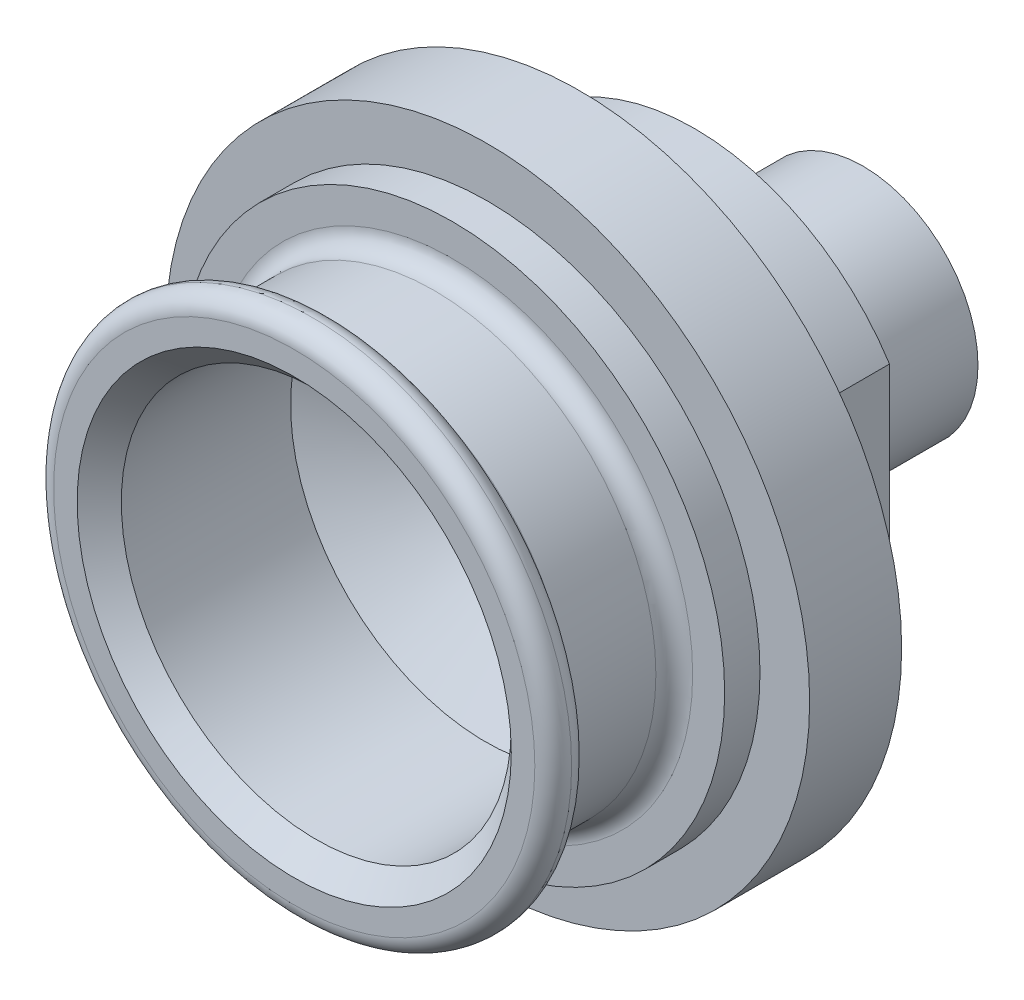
ISO-10303-21;
HEADER;
FILE_DESCRIPTION(('STEP AP214'),'2;1');
FILE_NAME('part.step','',(''),(''),'','','');
FILE_SCHEMA(('AUTOMOTIVE_DESIGN { 1 0 10303 214 1 1 1 1 }'));
ENDSEC;
DATA;
#1=APPLICATION_CONTEXT('core data for automotive mechanical design processes');
#2=APPLICATION_PROTOCOL_DEFINITION('international standard','automotive_design',2000,#1);
#3=PRODUCT_CONTEXT('',#1,'mechanical');
#4=PRODUCT('Part','Part','',(#3));
#5=PRODUCT_RELATED_PRODUCT_CATEGORY('part','',(#4));
#6=PRODUCT_DEFINITION_FORMATION('','',#4);
#7=PRODUCT_DEFINITION_CONTEXT('part definition',#1,'design');
#8=PRODUCT_DEFINITION('design','',#6,#7);
#9=PRODUCT_DEFINITION_SHAPE('','',#8);
#10=(LENGTH_UNIT() NAMED_UNIT(*) SI_UNIT(.MILLI.,.METRE.));
#11=(NAMED_UNIT(*) PLANE_ANGLE_UNIT() SI_UNIT($,.RADIAN.));
#12=(NAMED_UNIT(*) SI_UNIT($,.STERADIAN.) SOLID_ANGLE_UNIT());
#13=UNCERTAINTY_MEASURE_WITH_UNIT(LENGTH_MEASURE(1.E-05),#10,'distance_accuracy_value','');
#14=(GEOMETRIC_REPRESENTATION_CONTEXT(3) GLOBAL_UNCERTAINTY_ASSIGNED_CONTEXT((#13)) GLOBAL_UNIT_ASSIGNED_CONTEXT((#10,
#11,#12)) REPRESENTATION_CONTEXT('',''));
#15=CARTESIAN_POINT('',(0.,0.,0.));
#16=DIRECTION('',(0.,0.,1.));
#17=DIRECTION('',(1.,0.,0.));
#18=AXIS2_PLACEMENT_3D('',#15,#16,#17);
#19=CARTESIAN_POINT('',(0.,0.,9.779));
#20=DIRECTION('',(0.,0.,-1.));
#21=DIRECTION('',(-1.00000000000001,0.,0.));
#22=AXIS2_PLACEMENT_3D('',#19,#20,#21);
#23=CYLINDRICAL_SURFACE('',#22,8.001);
#24=CARTESIAN_POINT('',(0.,0.,9.779));
#25=DIRECTION('',(0.,0.,1.));
#26=DIRECTION('',(1.00000000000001,0.,0.));
#27=AXIS2_PLACEMENT_3D('',#24,#25,#26);
#28=CIRCLE('',#27,8.001);
#29=CARTESIAN_POINT('',(6.73100000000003,4.32546413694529,9.779));
#30=VERTEX_POINT('',#29);
#31=CARTESIAN_POINT('',(-6.73100000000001,4.32546413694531,9.779));
#32=VERTEX_POINT('',#31);
#33=EDGE_CURVE('E93',#30,#32,#28,.T.);
#34=ORIENTED_EDGE('',*,*,#33,.F.);
#35=DIRECTION('',(0.,0.,-1.));
#36=VECTOR('',#35,1.);
#37=CARTESIAN_POINT('',(6.73100000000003,4.32546413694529,9.779));
#38=LINE('',#37,#36);
#39=CARTESIAN_POINT('',(6.73100000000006,4.32546413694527,5.8166));
#40=VERTEX_POINT('',#39);
#41=EDGE_CURVE('E46',#30,#40,#38,.T.);
#42=ORIENTED_EDGE('',*,*,#41,.T.);
#43=CARTESIAN_POINT('',(0.,0.,5.8166));
#44=DIRECTION('',(0.,0.,1.));
#45=DIRECTION('',(1.00000000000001,0.,0.));
#46=AXIS2_PLACEMENT_3D('',#43,#44,#45);
#47=CIRCLE('',#46,8.001);
#48=CARTESIAN_POINT('',(-6.731,4.32546413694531,5.8166));
#49=VERTEX_POINT('',#48);
#50=EDGE_CURVE('E258',#40,#49,#47,.T.);
#51=ORIENTED_EDGE('',*,*,#50,.T.);
#52=DIRECTION('',(0.,0.,-1.));
#53=VECTOR('',#52,1.);
#54=CARTESIAN_POINT('',(-6.73100000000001,4.32546413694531,9.779));
#55=LINE('',#54,#53);
#56=EDGE_CURVE('E253',#49,#32,#55,.F.);
#57=ORIENTED_EDGE('',*,*,#56,.T.);
#58=EDGE_LOOP('',(#34,#42,#51,#57));
#59=FACE_BOUND('',#58,.T.);
#60=ADVANCED_FACE('F31',(#59),#23,.T.);
#61=CARTESIAN_POINT('',(0.,0.,4.2418));
#62=DIRECTION('',(0.,0.,-1.));
#63=DIRECTION('',(-1.00000000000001,0.,0.));
#64=AXIS2_PLACEMENT_3D('',#61,#62,#63);
#65=CYLINDRICAL_SURFACE('',#64,3.96875);
#66=CARTESIAN_POINT('',(0.,0.,4.2418));
#67=DIRECTION('',(0.,0.,1.));
#68=DIRECTION('',(1.00000000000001,0.,0.));
#69=AXIS2_PLACEMENT_3D('',#66,#67,#68);
#70=CIRCLE('',#69,3.96875);
#71=CARTESIAN_POINT('',(-3.96875000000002,0.,4.2418));
#72=VERTEX_POINT('',#71);
#73=EDGE_CURVE('E104',#72,#72,#70,.T.);
#74=CARTESIAN_POINT('',(0.,0.,0.));
#75=DIRECTION('',(0.,0.,1.));
#76=DIRECTION('',(1.00000000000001,0.,0.));
#77=AXIS2_PLACEMENT_3D('',#74,#75,#76);
#78=CIRCLE('',#77,3.96875);
#79=CARTESIAN_POINT('',(-3.96875000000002,0.,0.));
#80=VERTEX_POINT('',#79);
#81=EDGE_CURVE('E96',#80,#80,#78,.T.);
#82=CARTESIAN_POINT('',(-3.96875000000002,0.,4.2418));
#83=CARTESIAN_POINT('',(-3.96875000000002,0.,4.19761458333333));
#84=CARTESIAN_POINT('',(-3.96875000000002,0.,4.15342916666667));
#85=CARTESIAN_POINT('',(-3.96875000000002,0.,4.06505833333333));
#86=CARTESIAN_POINT('',(-3.96875000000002,0.,4.02087291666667));
#87=CARTESIAN_POINT('',(-3.96875000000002,0.,3.93250208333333));
#88=CARTESIAN_POINT('',(-3.96875000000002,0.,3.88831666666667));
#89=CARTESIAN_POINT('',(-3.96875000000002,0.,3.79994583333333));
#90=CARTESIAN_POINT('',(-3.96875000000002,0.,3.75576041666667));
#91=CARTESIAN_POINT('',(-3.96875000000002,0.,3.66738958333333));
#92=CARTESIAN_POINT('',(-3.96875000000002,0.,3.62320416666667));
#93=CARTESIAN_POINT('',(-3.96875000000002,0.,3.53483333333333));
#94=CARTESIAN_POINT('',(-3.96875000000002,0.,3.49064791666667));
#95=CARTESIAN_POINT('',(-3.96875000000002,0.,3.40227708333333));
#96=CARTESIAN_POINT('',(-3.96875000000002,0.,3.35809166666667));
#97=CARTESIAN_POINT('',(-3.96875000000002,0.,3.26972083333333));
#98=CARTESIAN_POINT('',(-3.96875000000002,0.,3.22553541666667));
#99=CARTESIAN_POINT('',(-3.96875000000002,0.,3.13716458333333));
#100=CARTESIAN_POINT('',(-3.96875000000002,0.,3.09297916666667));
#101=CARTESIAN_POINT('',(-3.96875000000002,0.,3.00460833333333));
#102=CARTESIAN_POINT('',(-3.96875000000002,0.,2.96042291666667));
#103=CARTESIAN_POINT('',(-3.96875000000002,0.,2.87205208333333));
#104=CARTESIAN_POINT('',(-3.96875000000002,0.,2.82786666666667));
#105=CARTESIAN_POINT('',(-3.96875000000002,0.,2.73949583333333));
#106=CARTESIAN_POINT('',(-3.96875000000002,0.,2.69531041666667));
#107=CARTESIAN_POINT('',(-3.96875000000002,0.,2.60693958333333));
#108=CARTESIAN_POINT('',(-3.96875000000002,0.,2.56275416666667));
#109=CARTESIAN_POINT('',(-3.96875000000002,0.,2.47438333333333));
#110=CARTESIAN_POINT('',(-3.96875000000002,0.,2.43019791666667));
#111=CARTESIAN_POINT('',(-3.96875000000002,0.,2.34182708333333));
#112=CARTESIAN_POINT('',(-3.96875000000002,0.,2.29764166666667));
#113=CARTESIAN_POINT('',(-3.96875000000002,0.,2.20927083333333));
#114=CARTESIAN_POINT('',(-3.96875000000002,0.,2.16508541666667));
#115=CARTESIAN_POINT('',(-3.96875000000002,0.,2.07671458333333));
#116=CARTESIAN_POINT('',(-3.96875000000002,0.,2.03252916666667));
#117=CARTESIAN_POINT('',(-3.96875000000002,0.,1.94415833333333));
#118=CARTESIAN_POINT('',(-3.96875000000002,0.,1.89997291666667));
#119=CARTESIAN_POINT('',(-3.96875000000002,0.,1.81160208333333));
#120=CARTESIAN_POINT('',(-3.96875000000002,0.,1.76741666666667));
#121=CARTESIAN_POINT('',(-3.96875000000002,0.,1.67904583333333));
#122=CARTESIAN_POINT('',(-3.96875000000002,0.,1.63486041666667));
#123=CARTESIAN_POINT('',(-3.96875000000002,0.,1.54648958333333));
#124=CARTESIAN_POINT('',(-3.96875000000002,0.,1.50230416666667));
#125=CARTESIAN_POINT('',(-3.96875000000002,0.,1.41393333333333));
#126=CARTESIAN_POINT('',(-3.96875000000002,0.,1.36974791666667));
#127=CARTESIAN_POINT('',(-3.96875000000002,0.,1.28137708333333));
#128=CARTESIAN_POINT('',(-3.96875000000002,0.,1.23719166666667));
#129=CARTESIAN_POINT('',(-3.96875000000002,0.,1.14882083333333));
#130=CARTESIAN_POINT('',(-3.96875000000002,0.,1.10463541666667));
#131=CARTESIAN_POINT('',(-3.96875000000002,0.,1.01626458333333));
#132=CARTESIAN_POINT('',(-3.96875000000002,0.,0.972079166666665));
#133=CARTESIAN_POINT('',(-3.96875000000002,0.,0.883708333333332));
#134=CARTESIAN_POINT('',(-3.96875000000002,0.,0.839522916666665));
#135=CARTESIAN_POINT('',(-3.96875000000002,0.,0.751152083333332));
#136=CARTESIAN_POINT('',(-3.96875000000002,0.,0.706966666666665));
#137=CARTESIAN_POINT('',(-3.96875000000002,0.,0.618595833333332));
#138=CARTESIAN_POINT('',(-3.96875000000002,0.,0.574410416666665));
#139=CARTESIAN_POINT('',(-3.96875000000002,0.,0.486039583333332));
#140=CARTESIAN_POINT('',(-3.96875000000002,0.,0.441854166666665));
#141=CARTESIAN_POINT('',(-3.96875000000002,0.,0.353483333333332));
#142=CARTESIAN_POINT('',(-3.96875000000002,0.,0.309297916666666));
#143=CARTESIAN_POINT('',(-3.96875000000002,0.,0.220927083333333));
#144=CARTESIAN_POINT('',(-3.96875000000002,0.,0.176741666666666));
#145=CARTESIAN_POINT('',(-3.96875000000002,0.,0.0883708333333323));
#146=CARTESIAN_POINT('',(-3.96875000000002,0.,0.0441854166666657));
#147=CARTESIAN_POINT('',(-3.96875000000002,0.,0.));
#148=B_SPLINE_CURVE_WITH_KNOTS('',3,(#82,#83,#84,#85,#86,#87,#88,#89,#90,#91,#92,#93,#94,#95,
#96,#97,#98,#99,#100,#101,#102,#103,#104,#105,#106,#107,#108,#109,#110,#111,#112,#113,#114,#115,
#116,#117,#118,#119,#120,#121,#122,#123,#124,#125,#126,#127,#128,#129,#130,#131,#132,#133,#134,
#135,#136,#137,#138,#139,#140,#141,#142,#143,#144,#145,#146,#147),.UNSPECIFIED.,.F.,.F.,(4,2,2,
2,2,2,2,2,2,2,2,2,2,2,2,2,2,2,2,2,2,2,2,2,2,2,2,2,2,2,2,2,4),(0.,0.132556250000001,0.2651125,
0.397668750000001,0.530225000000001,0.662781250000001,0.795337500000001,0.927893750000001,
1.06045,1.19300625,1.3255625,1.45811875,1.590675,1.72323125,1.8557875,1.98834375,2.1209,
2.25345625,2.3860125,2.51856875,2.651125,2.78368125,2.9162375,3.04879375,3.18135,3.31390625,
3.4464625,3.57901875,3.711575,3.84413125,3.9766875,4.10924375,4.2418),.UNSPECIFIED.);
#149=EDGE_CURVE('BSEAM33',#72,#80,#148,.T.);
#150=ORIENTED_EDGE('',*,*,#73,.F.);
#151=ORIENTED_EDGE('',*,*,#81,.T.);
#152=ORIENTED_EDGE('',*,*,#149,.T.);
#153=ORIENTED_EDGE('',*,*,#149,.F.);
#154=EDGE_LOOP('',(#150,#152,#151,#153));
#155=FACE_BOUND('',#154,.T.);
#156=ADVANCED_FACE('F33',(#155),#65,.T.);
#157=CARTESIAN_POINT('',(0.,0.,4.2418));
#158=DIRECTION('',(0.,0.,1.));
#159=DIRECTION('',(1.00000000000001,0.,0.));
#160=AXIS2_PLACEMENT_3D('',#157,#158,#159);
#161=PLANE('',#160);
#162=CARTESIAN_POINT('',(0.,0.,4.2418));
#163=DIRECTION('',(0.,0.,1.));
#164=DIRECTION('',(1.00000000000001,0.,0.));
#165=AXIS2_PLACEMENT_3D('',#162,#163,#164);
#166=CIRCLE('',#165,3.175);
#167=CARTESIAN_POINT('',(3.17500000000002,0.,4.2418));
#168=VERTEX_POINT('',#167);
#169=EDGE_CURVE('E101',#168,#168,#166,.T.);
#170=ORIENTED_EDGE('',*,*,#169,.F.);
#171=EDGE_LOOP('',(#170));
#172=FACE_BOUND('',#171,.T.);
#173=ORIENTED_EDGE('',*,*,#73,.T.);
#174=EDGE_LOOP('',(#173));
#175=FACE_BOUND('',#174,.T.);
#176=ADVANCED_FACE('F154',(#172,#175),#161,.T.);
#177=CARTESIAN_POINT('',(0.,0.,0.));
#178=DIRECTION('',(0.,0.,1.));
#179=DIRECTION('',(1.00000000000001,0.,0.));
#180=AXIS2_PLACEMENT_3D('',#177,#178,#179);
#181=PLANE('',#180);
#182=CARTESIAN_POINT('',(0.,0.,1.55014889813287E-11));
#183=DIRECTION('',(0.,0.,1.));
#184=DIRECTION('',(1.00000000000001,0.,0.));
#185=AXIS2_PLACEMENT_3D('',#182,#183,#184);
#186=CIRCLE('',#185,2.0828);
#187=CARTESIAN_POINT('',(2.08280000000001,0.,1.5501364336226E-11));
#188=VERTEX_POINT('',#187);
#189=EDGE_CURVE('E239',#188,#188,#186,.T.);
#190=ORIENTED_EDGE('',*,*,#189,.T.);
#191=EDGE_LOOP('',(#190));
#192=FACE_BOUND('',#191,.T.);
#193=ORIENTED_EDGE('',*,*,#81,.F.);
#194=EDGE_LOOP('',(#193));
#195=FACE_BOUND('',#194,.T.);
#196=ADVANCED_FACE('F171',(#192,#195),#181,.F.);
#197=CARTESIAN_POINT('',(0.,0.,5.8166));
#198=DIRECTION('',(0.,0.,-1.));
#199=DIRECTION('',(-1.00000000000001,0.,0.));
#200=AXIS2_PLACEMENT_3D('',#197,#198,#199);
#201=CYLINDRICAL_SURFACE('',#200,3.175);
#202=CARTESIAN_POINT('',(0.,0.,5.8166));
#203=DIRECTION('',(0.,0.,1.));
#204=DIRECTION('',(1.00000000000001,0.,0.));
#205=AXIS2_PLACEMENT_3D('',#202,#203,#204);
#206=CIRCLE('',#205,3.175);
#207=CARTESIAN_POINT('',(3.17500000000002,0.,5.8166));
#208=VERTEX_POINT('',#207);
#209=EDGE_CURVE('E92',#208,#208,#206,.T.);
#210=ORIENTED_EDGE('',*,*,#209,.F.);
#211=EDGE_LOOP('',(#210));
#212=FACE_BOUND('',#211,.T.);
#213=ORIENTED_EDGE('',*,*,#169,.T.);
#214=EDGE_LOOP('',(#213));
#215=FACE_BOUND('',#214,.T.);
#216=ADVANCED_FACE('F166',(#212,#215),#201,.T.);
#217=CARTESIAN_POINT('',(0.,0.,5.8166));
#218=DIRECTION('',(0.,0.,1.));
#219=DIRECTION('',(1.00000000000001,0.,0.));
#220=AXIS2_PLACEMENT_3D('',#217,#218,#219);
#221=PLANE('',#220);
#222=ORIENTED_EDGE('',*,*,#50,.F.);
#223=DIRECTION('',(0.,-1.00000000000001,0.));
#224=VECTOR('',#223,1.);
#225=CARTESIAN_POINT('',(6.73100000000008,0.,5.8166));
#226=LINE('',#225,#224);
#227=CARTESIAN_POINT('',(6.73100000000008,-4.32546413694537,5.8166));
#228=VERTEX_POINT('',#227);
#229=EDGE_CURVE('E80',#40,#228,#226,.T.);
#230=ORIENTED_EDGE('',*,*,#229,.T.);
#231=CARTESIAN_POINT('',(-6.731,-4.32546413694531,5.8166));
#232=VERTEX_POINT('',#231);
#233=EDGE_CURVE('E78',#232,#228,#47,.T.);
#234=ORIENTED_EDGE('',*,*,#233,.F.);
#235=DIRECTION('',(0.,1.00000000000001,0.));
#236=VECTOR('',#235,1.);
#237=CARTESIAN_POINT('',(-6.731,0.,5.8166));
#238=LINE('',#237,#236);
#239=EDGE_CURVE('E256',#232,#49,#238,.T.);
#240=ORIENTED_EDGE('',*,*,#239,.T.);
#241=EDGE_LOOP('',(#222,#230,#234,#240));
#242=FACE_BOUND('',#241,.T.);
#243=ORIENTED_EDGE('',*,*,#209,.T.);
#244=EDGE_LOOP('',(#243));
#245=FACE_BOUND('',#244,.T.);
#246=ADVANCED_FACE('F160',(#242,#245),#221,.F.);
#247=ORIENTED_EDGE('',*,*,#233,.T.);
#248=DIRECTION('',(0.,0.,-1.));
#249=VECTOR('',#248,1.);
#250=CARTESIAN_POINT('',(6.7310000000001,-4.32546413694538,9.779));
#251=LINE('',#250,#249);
#252=CARTESIAN_POINT('',(6.7310000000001,-4.32546413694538,9.779));
#253=VERTEX_POINT('',#252);
#254=EDGE_CURVE('E72',#228,#253,#251,.F.);
#255=ORIENTED_EDGE('',*,*,#254,.T.);
#256=CARTESIAN_POINT('',(-6.731,-4.32546413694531,9.779));
#257=VERTEX_POINT('',#256);
#258=EDGE_CURVE('E75',#257,#253,#28,.T.);
#259=ORIENTED_EDGE('',*,*,#258,.F.);
#260=DIRECTION('',(0.,0.,-1.));
#261=VECTOR('',#260,1.);
#262=CARTESIAN_POINT('',(-6.731,-4.32546413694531,9.779));
#263=LINE('',#262,#261);
#264=EDGE_CURVE('E54',#257,#232,#263,.T.);
#265=ORIENTED_EDGE('',*,*,#264,.T.);
#266=EDGE_LOOP('',(#247,#255,#259,#265));
#267=FACE_BOUND('',#266,.T.);
#268=ADVANCED_FACE('F73',(#267),#23,.T.);
#269=CARTESIAN_POINT('',(-6.73100000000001,10.16,0.));
#270=DIRECTION('',(1.00000000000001,0.,0.));
#271=DIRECTION('',(0.,1.00000000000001,0.));
#272=AXIS2_PLACEMENT_3D('',#269,#270,#271);
#273=PLANE('',#272);
#274=DIRECTION('',(0.,1.00000000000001,0.));
#275=VECTOR('',#274,1.);
#276=CARTESIAN_POINT('',(-6.73100000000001,10.16,9.779));
#277=LINE('',#276,#275);
#278=EDGE_CURVE('E91',#257,#32,#277,.T.);
#279=ORIENTED_EDGE('',*,*,#278,.T.);
#280=ORIENTED_EDGE('',*,*,#56,.F.);
#281=ORIENTED_EDGE('',*,*,#239,.F.);
#282=ORIENTED_EDGE('',*,*,#264,.F.);
#283=EDGE_LOOP('',(#279,#280,#281,#282));
#284=FACE_BOUND('',#283,.T.);
#285=ADVANCED_FACE('F159',(#284),#273,.F.);
#286=CARTESIAN_POINT('',(6.73100000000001,10.16,0.));
#287=DIRECTION('',(-1.00000000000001,0.,0.));
#288=DIRECTION('',(0.,-1.00000000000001,0.));
#289=AXIS2_PLACEMENT_3D('',#286,#287,#288);
#290=PLANE('',#289);
#291=DIRECTION('',(0.,-1.00000000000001,0.));
#292=VECTOR('',#291,1.);
#293=CARTESIAN_POINT('',(6.73100000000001,10.16,9.779));
#294=LINE('',#293,#292);
#295=EDGE_CURVE('E81',#30,#253,#294,.T.);
#296=ORIENTED_EDGE('',*,*,#295,.T.);
#297=ORIENTED_EDGE('',*,*,#254,.F.);
#298=ORIENTED_EDGE('',*,*,#229,.F.);
#299=ORIENTED_EDGE('',*,*,#41,.F.);
#300=EDGE_LOOP('',(#296,#297,#298,#299));
#301=FACE_BOUND('',#300,.T.);
#302=ADVANCED_FACE('F84',(#301),#290,.F.);
#303=CARTESIAN_POINT('',(0.,0.,12.954));
#304=DIRECTION('',(0.,0.,-1.));
#305=DIRECTION('',(-1.00000000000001,0.,0.));
#306=AXIS2_PLACEMENT_3D('',#303,#304,#305);
#307=CYLINDRICAL_SURFACE('',#306,11.1125);
#308=CARTESIAN_POINT('',(0.,0.,12.954));
#309=DIRECTION('',(0.,0.,1.));
#310=DIRECTION('',(1.00000000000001,0.,0.));
#311=AXIS2_PLACEMENT_3D('',#308,#309,#310);
#312=CIRCLE('',#311,11.1125);
#313=CARTESIAN_POINT('',(11.1125000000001,0.,12.954));
#314=VERTEX_POINT('',#313);
#315=EDGE_CURVE('E87',#314,#314,#312,.T.);
#316=ORIENTED_EDGE('',*,*,#315,.F.);
#317=EDGE_LOOP('',(#316));
#318=FACE_BOUND('',#317,.T.);
#319=CARTESIAN_POINT('',(0.,0.,9.779));
#320=DIRECTION('',(0.,0.,1.));
#321=DIRECTION('',(1.00000000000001,0.,0.));
#322=AXIS2_PLACEMENT_3D('',#319,#320,#321);
#323=CIRCLE('',#322,11.1125);
#324=CARTESIAN_POINT('',(11.1125000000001,0.,9.779));
#325=VERTEX_POINT('',#324);
#326=EDGE_CURVE('E238',#325,#325,#323,.T.);
#327=ORIENTED_EDGE('',*,*,#326,.T.);
#328=EDGE_LOOP('',(#327));
#329=FACE_BOUND('',#328,.T.);
#330=ADVANCED_FACE('F178',(#318,#329),#307,.T.);
#331=CARTESIAN_POINT('',(0.,0.,12.954));
#332=DIRECTION('',(0.,0.,1.));
#333=DIRECTION('',(1.00000000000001,0.,0.));
#334=AXIS2_PLACEMENT_3D('',#331,#332,#333);
#335=PLANE('',#334);
#336=CARTESIAN_POINT('',(0.,0.,12.954));
#337=DIRECTION('',(0.,0.,1.));
#338=DIRECTION('',(1.00000000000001,0.,0.));
#339=AXIS2_PLACEMENT_3D('',#336,#337,#338);
#340=CIRCLE('',#339,9.398);
#341=CARTESIAN_POINT('',(9.39800000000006,0.,12.954));
#342=VERTEX_POINT('',#341);
#343=EDGE_CURVE('E103',#342,#342,#340,.T.);
#344=ORIENTED_EDGE('',*,*,#343,.F.);
#345=EDGE_LOOP('',(#344));
#346=FACE_BOUND('',#345,.T.);
#347=ORIENTED_EDGE('',*,*,#315,.T.);
#348=EDGE_LOOP('',(#347));
#349=FACE_BOUND('',#348,.T.);
#350=ADVANCED_FACE('F181',(#346,#349),#335,.T.);
#351=CARTESIAN_POINT('',(0.,0.,9.779));
#352=DIRECTION('',(0.,0.,1.));
#353=DIRECTION('',(1.00000000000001,0.,0.));
#354=AXIS2_PLACEMENT_3D('',#351,#352,#353);
#355=PLANE('',#354);
#356=ORIENTED_EDGE('',*,*,#295,.F.);
#357=ORIENTED_EDGE('',*,*,#33,.T.);
#358=ORIENTED_EDGE('',*,*,#278,.F.);
#359=ORIENTED_EDGE('',*,*,#258,.T.);
#360=EDGE_LOOP('',(#356,#357,#358,#359));
#361=FACE_BOUND('',#360,.T.);
#362=ORIENTED_EDGE('',*,*,#326,.F.);
#363=EDGE_LOOP('',(#362));
#364=FACE_BOUND('',#363,.T.);
#365=ADVANCED_FACE('F89',(#361,#364),#355,.F.);
#366=CARTESIAN_POINT('',(0.,0.,14.1732));
#367=DIRECTION('',(0.,0.,-1.));
#368=DIRECTION('',(-1.00000000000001,0.,0.));
#369=AXIS2_PLACEMENT_3D('',#366,#367,#368);
#370=CYLINDRICAL_SURFACE('',#369,9.398);
#371=CARTESIAN_POINT('',(0.,0.,14.1732));
#372=DIRECTION('',(0.,0.,1.));
#373=DIRECTION('',(1.00000000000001,0.,0.));
#374=AXIS2_PLACEMENT_3D('',#371,#372,#373);
#375=CIRCLE('',#374,9.398);
#376=CARTESIAN_POINT('',(9.39800000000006,0.,14.1732));
#377=VERTEX_POINT('',#376);
#378=EDGE_CURVE('E237',#377,#377,#375,.T.);
#379=ORIENTED_EDGE('',*,*,#378,.F.);
#380=EDGE_LOOP('',(#379));
#381=FACE_BOUND('',#380,.T.);
#382=ORIENTED_EDGE('',*,*,#343,.T.);
#383=EDGE_LOOP('',(#382));
#384=FACE_BOUND('',#383,.T.);
#385=ADVANCED_FACE('F188',(#381,#384),#370,.T.);
#386=CARTESIAN_POINT('',(0.,0.,14.1732));
#387=DIRECTION('',(0.,0.,1.));
#388=DIRECTION('',(1.00000000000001,0.,0.));
#389=AXIS2_PLACEMENT_3D('',#386,#387,#388);
#390=PLANE('',#389);
#391=CARTESIAN_POINT('',(0.,0.,14.1732));
#392=DIRECTION('',(0.,0.,1.));
#393=DIRECTION('',(1.00000000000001,0.,0.));
#394=AXIS2_PLACEMENT_3D('',#391,#392,#393);
#395=CIRCLE('',#394,8.2931);
#396=CARTESIAN_POINT('',(8.29310000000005,0.,14.1732));
#397=VERTEX_POINT('',#396);
#398=EDGE_CURVE('E125',#397,#397,#395,.F.);
#399=ORIENTED_EDGE('',*,*,#398,.T.);
#400=EDGE_LOOP('',(#399));
#401=FACE_BOUND('',#400,.T.);
#402=ORIENTED_EDGE('',*,*,#378,.T.);
#403=EDGE_LOOP('',(#402));
#404=FACE_BOUND('',#403,.T.);
#405=ADVANCED_FACE('F191',(#401,#404),#390,.T.);
#406=CARTESIAN_POINT('',(0.,0.,18.3642));
#407=DIRECTION('',(0.,0.,-1.));
#408=DIRECTION('',(-1.00000000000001,0.,0.));
#409=AXIS2_PLACEMENT_3D('',#406,#407,#408);
#410=CYLINDRICAL_SURFACE('',#409,7.6581);
#411=CARTESIAN_POINT('',(0.,0.,17.7292));
#412=DIRECTION('',(0.,0.,1.));
#413=DIRECTION('',(1.00000000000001,0.,0.));
#414=AXIS2_PLACEMENT_3D('',#411,#412,#413);
#415=CIRCLE('',#414,7.6581);
#416=CARTESIAN_POINT('',(7.65810000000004,0.,17.7292));
#417=VERTEX_POINT('',#416);
#418=EDGE_CURVE('E122',#417,#417,#415,.F.);
#419=ORIENTED_EDGE('',*,*,#418,.T.);
#420=EDGE_LOOP('',(#419));
#421=FACE_BOUND('',#420,.T.);
#422=CARTESIAN_POINT('',(0.,0.,14.8082));
#423=DIRECTION('',(0.,0.,1.));
#424=DIRECTION('',(1.00000000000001,0.,0.));
#425=AXIS2_PLACEMENT_3D('',#422,#423,#424);
#426=CIRCLE('',#425,7.6581);
#427=CARTESIAN_POINT('',(7.65810000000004,0.,14.8082));
#428=VERTEX_POINT('',#427);
#429=EDGE_CURVE('E119',#428,#428,#426,.T.);
#430=ORIENTED_EDGE('',*,*,#429,.T.);
#431=EDGE_LOOP('',(#430));
#432=FACE_BOUND('',#431,.T.);
#433=ADVANCED_FACE('F195',(#421,#432),#410,.T.);
#434=CARTESIAN_POINT('',(0.,0.,18.3642));
#435=DIRECTION('',(0.,0.,1.));
#436=DIRECTION('',(1.00000000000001,0.,0.));
#437=AXIS2_PLACEMENT_3D('',#434,#435,#436);
#438=PLANE('',#437);
#439=CARTESIAN_POINT('',(0.,0.,18.3642));
#440=DIRECTION('',(0.,0.,1.));
#441=DIRECTION('',(1.00000000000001,0.,0.));
#442=AXIS2_PLACEMENT_3D('',#439,#440,#441);
#443=CIRCLE('',#442,8.3058);
#444=CARTESIAN_POINT('',(8.30580000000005,0.,18.3642));
#445=VERTEX_POINT('',#444);
#446=EDGE_CURVE('E116',#445,#445,#443,.F.);
#447=ORIENTED_EDGE('',*,*,#446,.T.);
#448=EDGE_LOOP('',(#447));
#449=FACE_BOUND('',#448,.T.);
#450=CARTESIAN_POINT('',(0.,0.,18.3642));
#451=DIRECTION('',(0.,0.,1.));
#452=DIRECTION('',(1.00000000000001,0.,0.));
#453=AXIS2_PLACEMENT_3D('',#450,#451,#452);
#454=CIRCLE('',#453,8.2931);
#455=CARTESIAN_POINT('',(8.29310000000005,0.,18.3642));
#456=VERTEX_POINT('',#455);
#457=EDGE_CURVE('E113',#456,#456,#454,.T.);
#458=ORIENTED_EDGE('',*,*,#457,.T.);
#459=EDGE_LOOP('',(#458));
#460=FACE_BOUND('',#459,.T.);
#461=ADVANCED_FACE('F199',(#449,#460),#438,.F.);
#462=CARTESIAN_POINT('',(0.,0.,19.6342));
#463=DIRECTION('',(0.,0.,1.));
#464=DIRECTION('',(1.00000000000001,0.,0.));
#465=AXIS2_PLACEMENT_3D('',#462,#463,#464);
#466=PLANE('',#465);
#467=CARTESIAN_POINT('',(0.,0.,19.6342));
#468=DIRECTION('',(0.,0.,1.));
#469=DIRECTION('',(1.00000000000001,0.,0.));
#470=AXIS2_PLACEMENT_3D('',#467,#468,#469);
#471=CIRCLE('',#470,7.493);
#472=CARTESIAN_POINT('',(7.49300000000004,0.,19.6342));
#473=VERTEX_POINT('',#472);
#474=EDGE_CURVE('E11',#473,#473,#471,.F.);
#475=ORIENTED_EDGE('',*,*,#474,.T.);
#476=EDGE_LOOP('',(#475));
#477=FACE_BOUND('',#476,.T.);
#478=CARTESIAN_POINT('',(0.,0.,19.6342));
#479=DIRECTION('',(0.,0.,1.));
#480=DIRECTION('',(1.00000000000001,0.,0.));
#481=AXIS2_PLACEMENT_3D('',#478,#479,#480);
#482=CIRCLE('',#481,8.3058);
#483=CARTESIAN_POINT('',(8.30580000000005,0.,19.6342));
#484=VERTEX_POINT('',#483);
#485=EDGE_CURVE('E128',#484,#484,#482,.T.);
#486=ORIENTED_EDGE('',*,*,#485,.T.);
#487=EDGE_LOOP('',(#486));
#488=FACE_BOUND('',#487,.T.);
#489=ADVANCED_FACE('F201',(#477,#488),#466,.T.);
#490=CARTESIAN_POINT('',(0.,0.,19.6342));
#491=DIRECTION('',(0.,0.,1.));
#492=DIRECTION('',(1.00000000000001,0.,0.));
#493=AXIS2_PLACEMENT_3D('',#490,#491,#492);
#494=CYLINDRICAL_SURFACE('',#493,2.0828);
#495=ORIENTED_EDGE('',*,*,#189,.F.);
#496=EDGE_LOOP('',(#495));
#497=FACE_BOUND('',#496,.T.);
#498=CARTESIAN_POINT('',(0.,0.,10.2372796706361));
#499=DIRECTION('',(0.,0.,1.));
#500=DIRECTION('',(1.00000000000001,0.,0.));
#501=AXIS2_PLACEMENT_3D('',#498,#499,#500);
#502=CIRCLE('',#501,2.0828);
#503=CARTESIAN_POINT('',(2.08280000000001,0.,10.2372796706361));
#504=VERTEX_POINT('',#503);
#505=EDGE_CURVE('E244',#504,#504,#502,.T.);
#506=ORIENTED_EDGE('',*,*,#505,.T.);
#507=EDGE_LOOP('',(#506));
#508=FACE_BOUND('',#507,.T.);
#509=ADVANCED_FACE('F204',(#497,#508),#494,.F.);
#510=CARTESIAN_POINT('',(0.,0.,13.0302));
#511=DIRECTION('',(0.,0.,1.));
#512=DIRECTION('',(1.00000000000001,0.,0.));
#513=AXIS2_PLACEMENT_3D('',#510,#511,#512);
#514=CONICAL_SURFACE('',#513,6.731,1.02974425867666);
#515=CARTESIAN_POINT('',(0.,0.,13.0302));
#516=DIRECTION('',(0.,0.,1.));
#517=DIRECTION('',(1.00000000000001,0.,0.));
#518=AXIS2_PLACEMENT_3D('',#515,#516,#517);
#519=CIRCLE('',#518,6.731);
#520=CARTESIAN_POINT('',(6.73100000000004,0.,13.0302));
#521=VERTEX_POINT('',#520);
#522=EDGE_CURVE('E268',#521,#521,#519,.T.);
#523=CARTESIAN_POINT('',(2.08280000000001,0.,10.2372796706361));
#524=CARTESIAN_POINT('',(2.13121875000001,0.,10.2663725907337));
#525=CARTESIAN_POINT('',(2.17963750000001,0.,10.2954655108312));
#526=CARTESIAN_POINT('',(2.27647500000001,0.,10.3536513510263));
#527=CARTESIAN_POINT('',(2.32489375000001,0.,10.3827442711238));
#528=CARTESIAN_POINT('',(2.42173125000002,0.,10.4409301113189));
#529=CARTESIAN_POINT('',(2.47015000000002,0.,10.4700230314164));
#530=CARTESIAN_POINT('',(2.56698750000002,0.,10.5282088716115));
#531=CARTESIAN_POINT('',(2.61540625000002,0.,10.5573017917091));
#532=CARTESIAN_POINT('',(2.71224375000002,0.,10.6154876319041));
#533=CARTESIAN_POINT('',(2.76066250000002,0.,10.6445805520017));
#534=CARTESIAN_POINT('',(2.85750000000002,0.,10.7027663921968));
#535=CARTESIAN_POINT('',(2.90591875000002,0.,10.7318593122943));
#536=CARTESIAN_POINT('',(3.00275625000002,0.,10.7900451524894));
#537=CARTESIAN_POINT('',(3.05117500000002,0.,10.8191380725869));
#538=CARTESIAN_POINT('',(3.14801250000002,0.,10.877323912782));
#539=CARTESIAN_POINT('',(3.19643125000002,0.,10.9064168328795));
#540=CARTESIAN_POINT('',(3.29326875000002,0.,10.9646026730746));
#541=CARTESIAN_POINT('',(3.34168750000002,0.,10.9936955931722));
#542=CARTESIAN_POINT('',(3.43852500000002,0.,11.0518814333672));
#543=CARTESIAN_POINT('',(3.48694375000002,0.,11.0809743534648));
#544=CARTESIAN_POINT('',(3.58378125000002,0.,11.1391601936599));
#545=CARTESIAN_POINT('',(3.63220000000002,0.,11.1682531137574));
#546=CARTESIAN_POINT('',(3.72903750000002,0.,11.2264389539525));
#547=CARTESIAN_POINT('',(3.77745625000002,0.,11.25553187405));
#548=CARTESIAN_POINT('',(3.87429375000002,0.,11.3137177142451));
#549=CARTESIAN_POINT('',(3.92271250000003,0.,11.3428106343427));
#550=CARTESIAN_POINT('',(4.01955000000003,0.,11.4009964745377));
#551=CARTESIAN_POINT('',(4.06796875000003,0.,11.4300893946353));
#552=CARTESIAN_POINT('',(4.16480625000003,0.,11.4882752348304));
#553=CARTESIAN_POINT('',(4.21322500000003,0.,11.5173681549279));
#554=CARTESIAN_POINT('',(4.31006250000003,0.,11.575553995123));
#555=CARTESIAN_POINT('',(4.35848125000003,0.,11.6046469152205));
#556=CARTESIAN_POINT('',(4.45531875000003,0.,11.6628327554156));
#557=CARTESIAN_POINT('',(4.50373750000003,0.,11.6919256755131));
#558=CARTESIAN_POINT('',(4.60057500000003,0.,11.7501115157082));
#559=CARTESIAN_POINT('',(4.64899375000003,0.,11.7792044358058));
#560=CARTESIAN_POINT('',(4.74583125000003,0.,11.8373902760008));
#561=CARTESIAN_POINT('',(4.79425000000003,0.,11.8664831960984));
#562=CARTESIAN_POINT('',(4.89108750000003,0.,11.9246690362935));
#563=CARTESIAN_POINT('',(4.93950625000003,0.,11.953761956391));
#564=CARTESIAN_POINT('',(5.03634375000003,0.,12.0119477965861));
#565=CARTESIAN_POINT('',(5.08476250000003,0.,12.0410407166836));
#566=CARTESIAN_POINT('',(5.18160000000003,0.,12.0992265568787));
#567=CARTESIAN_POINT('',(5.23001875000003,0.,12.1283194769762));
#568=CARTESIAN_POINT('',(5.32685625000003,0.,12.1865053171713));
#569=CARTESIAN_POINT('',(5.37527500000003,0.,12.2155982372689));
#570=CARTESIAN_POINT('',(5.47211250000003,0.,12.2737840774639));
#571=CARTESIAN_POINT('',(5.52053125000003,0.,12.3028769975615));
#572=CARTESIAN_POINT('',(5.61736875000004,0.,12.3610628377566));
#573=CARTESIAN_POINT('',(5.66578750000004,0.,12.3901557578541));
#574=CARTESIAN_POINT('',(5.76262500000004,0.,12.4483415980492));
#575=CARTESIAN_POINT('',(5.81104375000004,0.,12.4774345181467));
#576=CARTESIAN_POINT('',(5.90788125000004,0.,12.5356203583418));
#577=CARTESIAN_POINT('',(5.95630000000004,0.,12.5647132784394));
#578=CARTESIAN_POINT('',(6.05313750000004,0.,12.6228991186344));
#579=CARTESIAN_POINT('',(6.10155625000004,0.,12.651992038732));
#580=CARTESIAN_POINT('',(6.19839375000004,0.,12.7101778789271));
#581=CARTESIAN_POINT('',(6.24681250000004,0.,12.7392707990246));
#582=CARTESIAN_POINT('',(6.34365000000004,0.,12.7974566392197));
#583=CARTESIAN_POINT('',(6.39206875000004,0.,12.8265495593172));
#584=CARTESIAN_POINT('',(6.48890625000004,0.,12.8847353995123));
#585=CARTESIAN_POINT('',(6.53732500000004,0.,12.9138283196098));
#586=CARTESIAN_POINT('',(6.63416250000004,0.,12.9720141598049));
#587=CARTESIAN_POINT('',(6.68258125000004,0.,13.0011070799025));
#588=CARTESIAN_POINT('',(6.73100000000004,0.,13.0302));
#589=B_SPLINE_CURVE_WITH_KNOTS('',3,(#523,#524,#525,#526,#527,#528,#529,#530,#531,#532,#533,
#534,#535,#536,#537,#538,#539,#540,#541,#542,#543,#544,#545,#546,#547,#548,#549,#550,#551,#552,
#553,#554,#555,#556,#557,#558,#559,#560,#561,#562,#563,#564,#565,#566,#567,#568,#569,#570,#571,
#572,#573,#574,#575,#576,#577,#578,#579,#580,#581,#582,#583,#584,#585,#586,#587,#588),
.UNSPECIFIED.,.F.,.F.,(4,2,2,2,2,2,2,2,2,2,2,2,2,2,2,2,2,2,2,2,2,2,2,2,2,2,2,2,2,2,2,2,4),(0.,
0.16946079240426,0.33892158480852,0.50838237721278,0.67784316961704,0.847303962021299,
1.01676475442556,1.18622554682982,1.35568633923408,1.52514713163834,1.6946079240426,
1.86406871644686,2.03352950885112,2.20299030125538,2.37245109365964,2.5419118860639,
2.71137267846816,2.88083347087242,3.05029426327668,3.21975505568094,3.3892158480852,
3.55867664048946,3.72813743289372,3.89759822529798,4.06705901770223,4.23651981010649,
4.40598060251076,4.57544139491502,4.74490218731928,4.91436297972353,5.0838237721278,
5.25328456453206,5.42274535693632),.UNSPECIFIED.);
#590=EDGE_CURVE('BSEAM211',#504,#521,#589,.T.);
#591=ORIENTED_EDGE('',*,*,#505,.F.);
#592=ORIENTED_EDGE('',*,*,#522,.T.);
#593=ORIENTED_EDGE('',*,*,#590,.T.);
#594=ORIENTED_EDGE('',*,*,#590,.F.);
#595=EDGE_LOOP('',(#591,#593,#592,#594));
#596=FACE_BOUND('',#595,.T.);
#597=ADVANCED_FACE('F211',(#596),#514,.F.);
#598=CARTESIAN_POINT('',(0.,0.,19.6342));
#599=DIRECTION('',(0.,0.,1.));
#600=DIRECTION('',(1.00000000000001,0.,0.));
#601=AXIS2_PLACEMENT_3D('',#598,#599,#600);
#602=CYLINDRICAL_SURFACE('',#601,6.731);
#603=CARTESIAN_POINT('',(0.,0.,18.8722));
#604=DIRECTION('',(0.,0.,1.));
#605=DIRECTION('',(1.00000000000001,0.,0.));
#606=AXIS2_PLACEMENT_3D('',#603,#604,#605);
#607=CIRCLE('',#606,6.731);
#608=CARTESIAN_POINT('',(6.73100000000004,0.,18.8722));
#609=VERTEX_POINT('',#608);
#610=EDGE_CURVE('E39',#609,#609,#607,.T.);
#611=ORIENTED_EDGE('',*,*,#610,.T.);
#612=EDGE_LOOP('',(#611));
#613=FACE_BOUND('',#612,.T.);
#614=ORIENTED_EDGE('',*,*,#522,.F.);
#615=EDGE_LOOP('',(#614));
#616=FACE_BOUND('',#615,.T.);
#617=ADVANCED_FACE('F133',(#613,#616),#602,.F.);
#618=CARTESIAN_POINT('',(0.,0.,18.9992));
#619=DIRECTION('',(0.,0.,1.));
#620=DIRECTION('',(1.00000000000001,0.,0.));
#621=AXIS2_PLACEMENT_3D('',#618,#619,#620);
#622=TOROIDAL_SURFACE('',#621,8.3058,0.635);
#623=ORIENTED_EDGE('',*,*,#446,.F.);
#624=EDGE_LOOP('',(#623));
#625=FACE_BOUND('',#624,.T.);
#626=CARTESIAN_POINT('',(0.,0.,18.9992));
#627=DIRECTION('',(0.,0.,1.));
#628=DIRECTION('',(1.00000000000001,0.,0.));
#629=AXIS2_PLACEMENT_3D('',#626,#627,#628);
#630=CIRCLE('',#629,8.9408);
#631=CARTESIAN_POINT('',(8.94080000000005,0.,18.9992));
#632=VERTEX_POINT('',#631);
#633=EDGE_CURVE('E110',#632,#632,#630,.T.);
#634=ORIENTED_EDGE('',*,*,#633,.F.);
#635=EDGE_LOOP('',(#634));
#636=FACE_BOUND('',#635,.T.);
#637=ADVANCED_FACE('F218',(#625,#636),#622,.T.);
#638=CARTESIAN_POINT('',(0.,0.,17.7292));
#639=DIRECTION('',(0.,0.,1.));
#640=DIRECTION('',(1.00000000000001,0.,0.));
#641=AXIS2_PLACEMENT_3D('',#638,#639,#640);
#642=TOROIDAL_SURFACE('',#641,8.2931,0.635);
#643=ORIENTED_EDGE('',*,*,#418,.F.);
#644=EDGE_LOOP('',(#643));
#645=FACE_BOUND('',#644,.T.);
#646=ORIENTED_EDGE('',*,*,#457,.F.);
#647=EDGE_LOOP('',(#646));
#648=FACE_BOUND('',#647,.T.);
#649=ADVANCED_FACE('F221',(#645,#648),#642,.F.);
#650=CARTESIAN_POINT('',(0.,0.,14.8082));
#651=DIRECTION('',(0.,0.,1.));
#652=DIRECTION('',(1.00000000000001,0.,0.));
#653=AXIS2_PLACEMENT_3D('',#650,#651,#652);
#654=TOROIDAL_SURFACE('',#653,8.2931,0.635);
#655=ORIENTED_EDGE('',*,*,#398,.F.);
#656=EDGE_LOOP('',(#655));
#657=FACE_BOUND('',#656,.T.);
#658=ORIENTED_EDGE('',*,*,#429,.F.);
#659=EDGE_LOOP('',(#658));
#660=FACE_BOUND('',#659,.T.);
#661=ADVANCED_FACE('F144',(#657,#660),#654,.F.);
#662=CARTESIAN_POINT('',(0.,0.,18.9992));
#663=DIRECTION('',(0.,0.,1.));
#664=DIRECTION('',(1.00000000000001,0.,0.));
#665=AXIS2_PLACEMENT_3D('',#662,#663,#664);
#666=TOROIDAL_SURFACE('',#665,8.3058,0.635);
#667=ORIENTED_EDGE('',*,*,#633,.T.);
#668=EDGE_LOOP('',(#667));
#669=FACE_BOUND('',#668,.T.);
#670=ORIENTED_EDGE('',*,*,#485,.F.);
#671=EDGE_LOOP('',(#670));
#672=FACE_BOUND('',#671,.T.);
#673=ADVANCED_FACE('F138',(#669,#672),#666,.T.);
#674=CARTESIAN_POINT('',(0.,0.,18.8722));
#675=DIRECTION('',(0.,0.,1.));
#676=DIRECTION('',(1.00000000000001,0.,0.));
#677=AXIS2_PLACEMENT_3D('',#674,#675,#676);
#678=CONICAL_SURFACE('',#677,6.731,0.785398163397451);
#679=ORIENTED_EDGE('',*,*,#474,.F.);
#680=EDGE_LOOP('',(#679));
#681=FACE_BOUND('',#680,.T.);
#682=ORIENTED_EDGE('',*,*,#610,.F.);
#683=EDGE_LOOP('',(#682));
#684=FACE_BOUND('',#683,.T.);
#685=ADVANCED_FACE('F136',(#681,#684),#678,.F.);
#686=CLOSED_SHELL('',(#60,#156,#176,#196,#216,#246,#268,#285,#302,#330,#350,#365,#385,#405,#433,
#461,#489,#509,#597,#617,#637,#649,#661,#673,#685));
#687=MANIFOLD_SOLID_BREP('B2',#686);
#688=ADVANCED_BREP_SHAPE_REPRESENTATION('',(#18,#687),#14);
#689=SHAPE_DEFINITION_REPRESENTATION(#9,#688);
ENDSEC;
END-ISO-10303-21;
